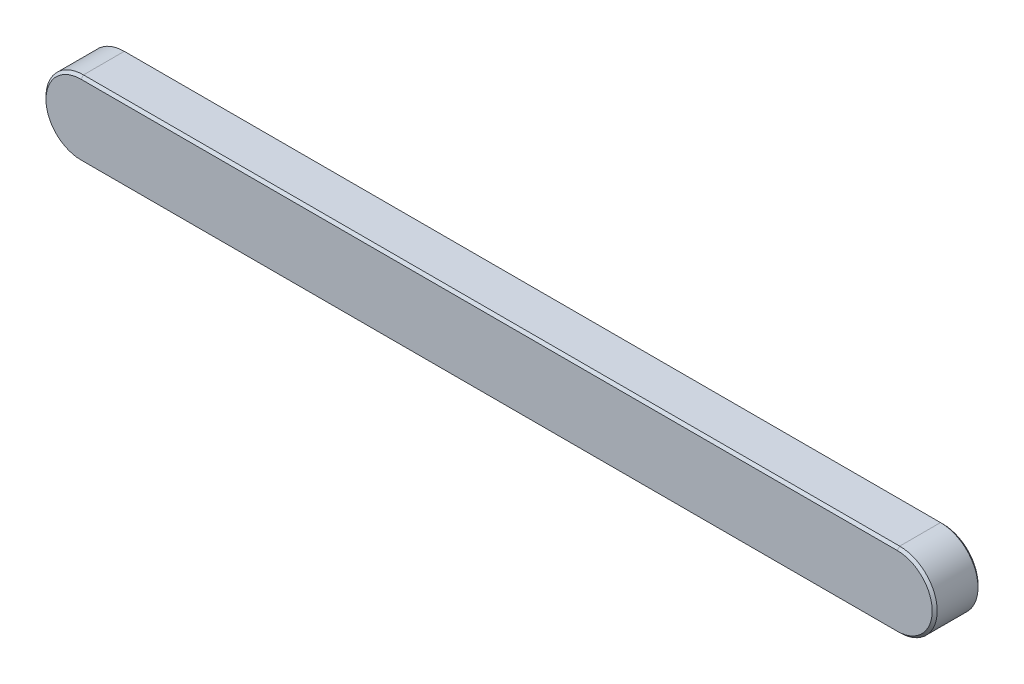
from build123d import *

# Parameters (mm, degrees)
BASE_EXTRUSION_DEPTH = 11
CHANFREIN1_SIZE      = 0.6


with BuildPart() as part:
    # Esquisse1 → Base-Extrusion (new body)
    with BuildSketch(Plane.XY):
        with BuildLine():
            Line((0, 0), (196, 0))
            ThreePointArc((196, 0), (205, 9), (196, 18))
            Line((196, 18), (0, 18))
            ThreePointArc((0, 18), (-9, 9), (0, 0))
        make_face()
    extrude(amount=BASE_EXTRUSION_DEPTH)

    # Chanfrein1
    chanfrein1_edges = [part.edges().sort_by_distance(p)[0] for p in [
        (205, 9, 11),
        (98, 18, 11),
        (-9, 9, 11),
        (98, 18, 0),
        (205, 9, 0),
        (98, 0, 0),
        (-9, 9, 0),
        (98, 0, 11),
    ]]
    chamfer(chanfrein1_edges, length=CHANFREIN1_SIZE)


solid = part.part
